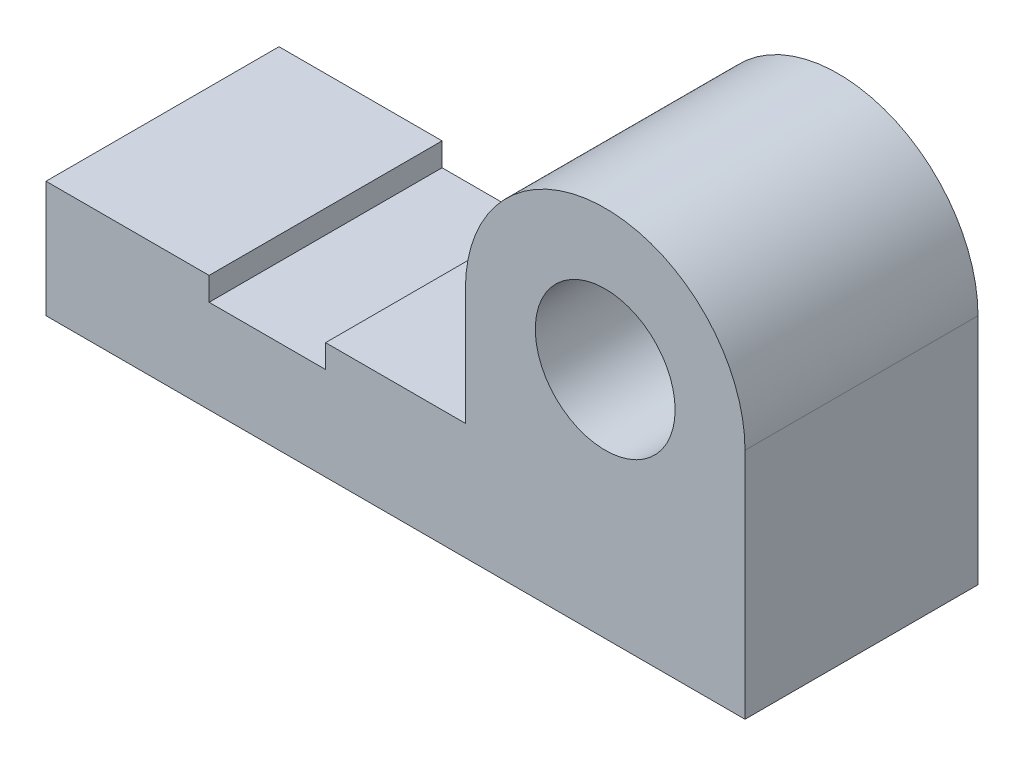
ISO-10303-21;
HEADER;
FILE_DESCRIPTION(('STEP AP214'),'2;1');
FILE_NAME('part.step','',(''),(''),'','','');
FILE_SCHEMA(('AUTOMOTIVE_DESIGN { 1 0 10303 214 1 1 1 1 }'));
ENDSEC;
DATA;
#1=APPLICATION_CONTEXT('core data for automotive mechanical design processes');
#2=APPLICATION_PROTOCOL_DEFINITION('international standard','automotive_design',2000,#1);
#3=PRODUCT_CONTEXT('',#1,'mechanical');
#4=PRODUCT('Part','Part','',(#3));
#5=PRODUCT_RELATED_PRODUCT_CATEGORY('part','',(#4));
#6=PRODUCT_DEFINITION_FORMATION('','',#4);
#7=PRODUCT_DEFINITION_CONTEXT('part definition',#1,'design');
#8=PRODUCT_DEFINITION('design','',#6,#7);
#9=PRODUCT_DEFINITION_SHAPE('','',#8);
#10=(LENGTH_UNIT() NAMED_UNIT(*) SI_UNIT(.MILLI.,.METRE.));
#11=(NAMED_UNIT(*) PLANE_ANGLE_UNIT() SI_UNIT($,.RADIAN.));
#12=(NAMED_UNIT(*) SI_UNIT($,.STERADIAN.) SOLID_ANGLE_UNIT());
#13=UNCERTAINTY_MEASURE_WITH_UNIT(LENGTH_MEASURE(1.E-05),#10,'distance_accuracy_value','');
#14=(GEOMETRIC_REPRESENTATION_CONTEXT(3) GLOBAL_UNCERTAINTY_ASSIGNED_CONTEXT((#13)) GLOBAL_UNIT_ASSIGNED_CONTEXT((#10,
#11,#12)) REPRESENTATION_CONTEXT('',''));
#15=CARTESIAN_POINT('',(0.,0.,0.));
#16=DIRECTION('',(0.,0.,1.));
#17=DIRECTION('',(1.,0.,0.));
#18=AXIS2_PLACEMENT_3D('',#15,#16,#17);
#19=CARTESIAN_POINT('',(120.,50.,50.));
#20=DIRECTION('',(0.,0.,1.));
#21=DIRECTION('',(1.,0.,0.));
#22=AXIS2_PLACEMENT_3D('',#19,#20,#21);
#23=PLANE('',#22);
#24=DIRECTION('',(0.,-1.,0.));
#25=VECTOR('',#24,1.);
#26=CARTESIAN_POINT('',(0.,25.,50.));
#27=LINE('',#26,#25);
#28=CARTESIAN_POINT('',(0.,25.,50.));
#29=VERTEX_POINT('',#28);
#30=CARTESIAN_POINT('',(0.,0.,50.));
#31=VERTEX_POINT('',#30);
#32=EDGE_CURVE('E159',#29,#31,#27,.T.);
#33=ORIENTED_EDGE('',*,*,#32,.T.);
#34=DIRECTION('',(1.,0.,0.));
#35=VECTOR('',#34,1.);
#36=CARTESIAN_POINT('',(0.,0.,50.));
#37=LINE('',#36,#35);
#38=CARTESIAN_POINT('',(150.,0.,50.));
#39=VERTEX_POINT('',#38);
#40=EDGE_CURVE('E97',#31,#39,#37,.T.);
#41=ORIENTED_EDGE('',*,*,#40,.T.);
#42=DIRECTION('',(0.,1.,0.));
#43=VECTOR('',#42,1.);
#44=CARTESIAN_POINT('',(150.,0.,50.));
#45=LINE('',#44,#43);
#46=CARTESIAN_POINT('',(150.,50.,50.));
#47=VERTEX_POINT('',#46);
#48=EDGE_CURVE('E180',#39,#47,#45,.T.);
#49=ORIENTED_EDGE('',*,*,#48,.T.);
#50=CARTESIAN_POINT('',(120.,50.,50.));
#51=DIRECTION('',(0.,0.,1.));
#52=DIRECTION('',(1.,0.,0.));
#53=AXIS2_PLACEMENT_3D('',#50,#51,#52);
#54=CIRCLE('',#53,30.);
#55=CARTESIAN_POINT('',(90.,50.,50.));
#56=VERTEX_POINT('',#55);
#57=EDGE_CURVE('E199',#47,#56,#54,.T.);
#58=ORIENTED_EDGE('',*,*,#57,.T.);
#59=DIRECTION('',(0.,-1.,0.));
#60=VECTOR('',#59,1.);
#61=CARTESIAN_POINT('',(90.,50.,50.));
#62=LINE('',#61,#60);
#63=CARTESIAN_POINT('',(90.,25.,50.));
#64=VERTEX_POINT('',#63);
#65=EDGE_CURVE('E196',#56,#64,#62,.T.);
#66=ORIENTED_EDGE('',*,*,#65,.T.);
#67=DIRECTION('',(-1.,0.,0.));
#68=VECTOR('',#67,1.);
#69=CARTESIAN_POINT('',(90.,25.,50.));
#70=LINE('',#69,#68);
#71=CARTESIAN_POINT('',(60.,25.,50.));
#72=VERTEX_POINT('',#71);
#73=EDGE_CURVE('E198',#64,#72,#70,.T.);
#74=ORIENTED_EDGE('',*,*,#73,.T.);
#75=DIRECTION('',(0.,-1.,0.));
#76=VECTOR('',#75,1.);
#77=CARTESIAN_POINT('',(60.,25.,50.));
#78=LINE('',#77,#76);
#79=CARTESIAN_POINT('',(60.,20.,50.));
#80=VERTEX_POINT('',#79);
#81=EDGE_CURVE('E122',#72,#80,#78,.T.);
#82=ORIENTED_EDGE('',*,*,#81,.T.);
#83=DIRECTION('',(-1.,0.,0.));
#84=VECTOR('',#83,1.);
#85=CARTESIAN_POINT('',(60.,20.,50.));
#86=LINE('',#85,#84);
#87=CARTESIAN_POINT('',(35.,20.,50.));
#88=VERTEX_POINT('',#87);
#89=EDGE_CURVE('E116',#80,#88,#86,.T.);
#90=ORIENTED_EDGE('',*,*,#89,.T.);
#91=DIRECTION('',(0.,1.,0.));
#92=VECTOR('',#91,1.);
#93=CARTESIAN_POINT('',(35.,20.,50.));
#94=LINE('',#93,#92);
#95=CARTESIAN_POINT('',(35.,25.,50.));
#96=VERTEX_POINT('',#95);
#97=EDGE_CURVE('E120',#88,#96,#94,.T.);
#98=ORIENTED_EDGE('',*,*,#97,.T.);
#99=DIRECTION('',(-1.,0.,0.));
#100=VECTOR('',#99,1.);
#101=CARTESIAN_POINT('',(35.,25.,50.));
#102=LINE('',#101,#100);
#103=EDGE_CURVE('E48',#96,#29,#102,.T.);
#104=ORIENTED_EDGE('',*,*,#103,.T.);
#105=EDGE_LOOP('',(#33,#41,#49,#58,#66,#74,#82,#90,#98,#104));
#106=FACE_BOUND('',#105,.T.);
#107=CARTESIAN_POINT('',(120.,50.,50.));
#108=DIRECTION('',(0.,0.,1.));
#109=DIRECTION('',(1.,0.,0.));
#110=AXIS2_PLACEMENT_3D('',#107,#108,#109);
#111=CIRCLE('',#110,15.);
#112=CARTESIAN_POINT('',(135.,50.,50.));
#113=VERTEX_POINT('',#112);
#114=EDGE_CURVE('E144',#113,#113,#111,.T.);
#115=ORIENTED_EDGE('',*,*,#114,.F.);
#116=EDGE_LOOP('',(#115));
#117=FACE_BOUND('',#116,.T.);
#118=ADVANCED_FACE('F31',(#106,#117),#23,.T.);
#119=CARTESIAN_POINT('',(120.,50.,0.));
#120=DIRECTION('',(0.,0.,1.));
#121=DIRECTION('',(1.,0.,0.));
#122=AXIS2_PLACEMENT_3D('',#119,#120,#121);
#123=PLANE('',#122);
#124=DIRECTION('',(0.,-1.,0.));
#125=VECTOR('',#124,1.);
#126=CARTESIAN_POINT('',(0.,25.,0.));
#127=LINE('',#126,#125);
#128=CARTESIAN_POINT('',(0.,25.,0.));
#129=VERTEX_POINT('',#128);
#130=CARTESIAN_POINT('',(0.,0.,0.));
#131=VERTEX_POINT('',#130);
#132=EDGE_CURVE('E140',#129,#131,#127,.T.);
#133=ORIENTED_EDGE('',*,*,#132,.F.);
#134=DIRECTION('',(-1.,0.,0.));
#135=VECTOR('',#134,1.);
#136=CARTESIAN_POINT('',(35.,25.,0.));
#137=LINE('',#136,#135);
#138=CARTESIAN_POINT('',(35.,25.,0.));
#139=VERTEX_POINT('',#138);
#140=EDGE_CURVE('E89',#139,#129,#137,.T.);
#141=ORIENTED_EDGE('',*,*,#140,.F.);
#142=DIRECTION('',(0.,1.,0.));
#143=VECTOR('',#142,1.);
#144=CARTESIAN_POINT('',(35.,20.,0.));
#145=LINE('',#144,#143);
#146=CARTESIAN_POINT('',(35.,20.,0.));
#147=VERTEX_POINT('',#146);
#148=EDGE_CURVE('E83',#147,#139,#145,.T.);
#149=ORIENTED_EDGE('',*,*,#148,.F.);
#150=DIRECTION('',(-1.,0.,0.));
#151=VECTOR('',#150,1.);
#152=CARTESIAN_POINT('',(60.,20.,0.));
#153=LINE('',#152,#151);
#154=CARTESIAN_POINT('',(60.,20.,0.));
#155=VERTEX_POINT('',#154);
#156=EDGE_CURVE('E130',#155,#147,#153,.T.);
#157=ORIENTED_EDGE('',*,*,#156,.F.);
#158=DIRECTION('',(0.,-1.,0.));
#159=VECTOR('',#158,1.);
#160=CARTESIAN_POINT('',(60.,25.,0.));
#161=LINE('',#160,#159);
#162=CARTESIAN_POINT('',(60.,25.,0.));
#163=VERTEX_POINT('',#162);
#164=EDGE_CURVE('E154',#163,#155,#161,.T.);
#165=ORIENTED_EDGE('',*,*,#164,.F.);
#166=DIRECTION('',(-1.,0.,0.));
#167=VECTOR('',#166,1.);
#168=CARTESIAN_POINT('',(90.,25.,0.));
#169=LINE('',#168,#167);
#170=CARTESIAN_POINT('',(90.,25.,0.));
#171=VERTEX_POINT('',#170);
#172=EDGE_CURVE('E152',#171,#163,#169,.T.);
#173=ORIENTED_EDGE('',*,*,#172,.F.);
#174=DIRECTION('',(0.,-1.,0.));
#175=VECTOR('',#174,1.);
#176=CARTESIAN_POINT('',(90.,50.,0.));
#177=LINE('',#176,#175);
#178=CARTESIAN_POINT('',(90.,50.,0.));
#179=VERTEX_POINT('',#178);
#180=EDGE_CURVE('E150',#179,#171,#177,.T.);
#181=ORIENTED_EDGE('',*,*,#180,.F.);
#182=CARTESIAN_POINT('',(120.,50.,0.));
#183=DIRECTION('',(0.,0.,1.));
#184=DIRECTION('',(1.,0.,0.));
#185=AXIS2_PLACEMENT_3D('',#182,#183,#184);
#186=CIRCLE('',#185,30.);
#187=CARTESIAN_POINT('',(150.,50.,0.));
#188=VERTEX_POINT('',#187);
#189=EDGE_CURVE('E148',#188,#179,#186,.T.);
#190=ORIENTED_EDGE('',*,*,#189,.F.);
#191=DIRECTION('',(0.,1.,0.));
#192=VECTOR('',#191,1.);
#193=CARTESIAN_POINT('',(150.,0.,0.));
#194=LINE('',#193,#192);
#195=CARTESIAN_POINT('',(150.,0.,0.));
#196=VERTEX_POINT('',#195);
#197=EDGE_CURVE('E146',#196,#188,#194,.T.);
#198=ORIENTED_EDGE('',*,*,#197,.F.);
#199=DIRECTION('',(1.,0.,0.));
#200=VECTOR('',#199,1.);
#201=CARTESIAN_POINT('',(0.,0.,0.));
#202=LINE('',#201,#200);
#203=EDGE_CURVE('E143',#131,#196,#202,.T.);
#204=ORIENTED_EDGE('',*,*,#203,.F.);
#205=EDGE_LOOP('',(#133,#141,#149,#157,#165,#173,#181,#190,#198,#204));
#206=FACE_BOUND('',#205,.T.);
#207=CARTESIAN_POINT('',(120.,50.,0.));
#208=DIRECTION('',(0.,0.,1.));
#209=DIRECTION('',(1.,0.,0.));
#210=AXIS2_PLACEMENT_3D('',#207,#208,#209);
#211=CIRCLE('',#210,15.);
#212=CARTESIAN_POINT('',(135.,50.,0.));
#213=VERTEX_POINT('',#212);
#214=EDGE_CURVE('E207',#213,#213,#211,.T.);
#215=ORIENTED_EDGE('',*,*,#214,.T.);
#216=EDGE_LOOP('',(#215));
#217=FACE_BOUND('',#216,.T.);
#218=ADVANCED_FACE('F184',(#206,#217),#123,.F.);
#219=CARTESIAN_POINT('',(0.,25.,50.));
#220=DIRECTION('',(1.,0.,0.));
#221=DIRECTION('',(0.,1.,0.));
#222=AXIS2_PLACEMENT_3D('',#219,#220,#221);
#223=PLANE('',#222);
#224=ORIENTED_EDGE('',*,*,#132,.T.);
#225=DIRECTION('',(0.,0.,-1.));
#226=VECTOR('',#225,1.);
#227=CARTESIAN_POINT('',(0.,0.,50.));
#228=LINE('',#227,#226);
#229=EDGE_CURVE('E11',#31,#131,#228,.T.);
#230=ORIENTED_EDGE('',*,*,#229,.F.);
#231=ORIENTED_EDGE('',*,*,#32,.F.);
#232=DIRECTION('',(0.,0.,-1.));
#233=VECTOR('',#232,1.);
#234=CARTESIAN_POINT('',(0.,25.,50.));
#235=LINE('',#234,#233);
#236=EDGE_CURVE('E136',#29,#129,#235,.T.);
#237=ORIENTED_EDGE('',*,*,#236,.T.);
#238=EDGE_LOOP('',(#224,#230,#231,#237));
#239=FACE_BOUND('',#238,.T.);
#240=ADVANCED_FACE('F33',(#239),#223,.F.);
#241=CARTESIAN_POINT('',(0.,0.,50.));
#242=DIRECTION('',(0.,1.,0.));
#243=DIRECTION('',(0.,0.,1.));
#244=AXIS2_PLACEMENT_3D('',#241,#242,#243);
#245=PLANE('',#244);
#246=ORIENTED_EDGE('',*,*,#203,.T.);
#247=DIRECTION('',(0.,0.,-1.));
#248=VECTOR('',#247,1.);
#249=CARTESIAN_POINT('',(150.,0.,50.));
#250=LINE('',#249,#248);
#251=EDGE_CURVE('E40',#39,#196,#250,.T.);
#252=ORIENTED_EDGE('',*,*,#251,.F.);
#253=ORIENTED_EDGE('',*,*,#40,.F.);
#254=ORIENTED_EDGE('',*,*,#229,.T.);
#255=EDGE_LOOP('',(#246,#252,#253,#254));
#256=FACE_BOUND('',#255,.T.);
#257=ADVANCED_FACE('F243',(#256),#245,.F.);
#258=CARTESIAN_POINT('',(150.,0.,50.));
#259=DIRECTION('',(-1.,0.,0.));
#260=DIRECTION('',(0.,-1.,0.));
#261=AXIS2_PLACEMENT_3D('',#258,#259,#260);
#262=PLANE('',#261);
#263=ORIENTED_EDGE('',*,*,#197,.T.);
#264=DIRECTION('',(0.,0.,-1.));
#265=VECTOR('',#264,1.);
#266=CARTESIAN_POINT('',(150.,50.,50.));
#267=LINE('',#266,#265);
#268=EDGE_CURVE('E172',#47,#188,#267,.T.);
#269=ORIENTED_EDGE('',*,*,#268,.F.);
#270=ORIENTED_EDGE('',*,*,#48,.F.);
#271=ORIENTED_EDGE('',*,*,#251,.T.);
#272=EDGE_LOOP('',(#263,#269,#270,#271));
#273=FACE_BOUND('',#272,.T.);
#274=ADVANCED_FACE('F178',(#273),#262,.F.);
#275=CARTESIAN_POINT('',(120.,50.,50.));
#276=DIRECTION('',(0.,0.,-1.));
#277=DIRECTION('',(-1.,0.,0.));
#278=AXIS2_PLACEMENT_3D('',#275,#276,#277);
#279=CYLINDRICAL_SURFACE('',#278,30.);
#280=ORIENTED_EDGE('',*,*,#189,.T.);
#281=DIRECTION('',(0.,0.,-1.));
#282=VECTOR('',#281,1.);
#283=CARTESIAN_POINT('',(90.,50.,50.));
#284=LINE('',#283,#282);
#285=EDGE_CURVE('E169',#56,#179,#284,.T.);
#286=ORIENTED_EDGE('',*,*,#285,.F.);
#287=ORIENTED_EDGE('',*,*,#57,.F.);
#288=ORIENTED_EDGE('',*,*,#268,.T.);
#289=EDGE_LOOP('',(#280,#286,#287,#288));
#290=FACE_BOUND('',#289,.T.);
#291=ADVANCED_FACE('F190',(#290),#279,.T.);
#292=CARTESIAN_POINT('',(90.,50.,50.));
#293=DIRECTION('',(1.,0.,0.));
#294=DIRECTION('',(0.,0.,-1.));
#295=AXIS2_PLACEMENT_3D('',#292,#293,#294);
#296=PLANE('',#295);
#297=ORIENTED_EDGE('',*,*,#180,.T.);
#298=DIRECTION('',(0.,0.,-1.));
#299=VECTOR('',#298,1.);
#300=CARTESIAN_POINT('',(90.,25.,50.));
#301=LINE('',#300,#299);
#302=EDGE_CURVE('E166',#64,#171,#301,.T.);
#303=ORIENTED_EDGE('',*,*,#302,.F.);
#304=ORIENTED_EDGE('',*,*,#65,.F.);
#305=ORIENTED_EDGE('',*,*,#285,.T.);
#306=EDGE_LOOP('',(#297,#303,#304,#305));
#307=FACE_BOUND('',#306,.T.);
#308=ADVANCED_FACE('F194',(#307),#296,.F.);
#309=CARTESIAN_POINT('',(90.,25.,50.));
#310=DIRECTION('',(0.,-1.,0.));
#311=DIRECTION('',(1.,0.,0.));
#312=AXIS2_PLACEMENT_3D('',#309,#310,#311);
#313=PLANE('',#312);
#314=ORIENTED_EDGE('',*,*,#172,.T.);
#315=DIRECTION('',(0.,0.,-1.));
#316=VECTOR('',#315,1.);
#317=CARTESIAN_POINT('',(60.,25.,50.));
#318=LINE('',#317,#316);
#319=EDGE_CURVE('E163',#72,#163,#318,.T.);
#320=ORIENTED_EDGE('',*,*,#319,.F.);
#321=ORIENTED_EDGE('',*,*,#73,.F.);
#322=ORIENTED_EDGE('',*,*,#302,.T.);
#323=EDGE_LOOP('',(#314,#320,#321,#322));
#324=FACE_BOUND('',#323,.T.);
#325=ADVANCED_FACE('F233',(#324),#313,.F.);
#326=CARTESIAN_POINT('',(60.,25.,50.));
#327=DIRECTION('',(1.,0.,0.));
#328=DIRECTION('',(0.,1.,0.));
#329=AXIS2_PLACEMENT_3D('',#326,#327,#328);
#330=PLANE('',#329);
#331=ORIENTED_EDGE('',*,*,#164,.T.);
#332=DIRECTION('',(0.,0.,-1.));
#333=VECTOR('',#332,1.);
#334=CARTESIAN_POINT('',(60.,20.,50.));
#335=LINE('',#334,#333);
#336=EDGE_CURVE('E131',#80,#155,#335,.T.);
#337=ORIENTED_EDGE('',*,*,#336,.F.);
#338=ORIENTED_EDGE('',*,*,#81,.F.);
#339=ORIENTED_EDGE('',*,*,#319,.T.);
#340=EDGE_LOOP('',(#331,#337,#338,#339));
#341=FACE_BOUND('',#340,.T.);
#342=ADVANCED_FACE('F230',(#341),#330,.F.);
#343=CARTESIAN_POINT('',(60.,20.,50.));
#344=DIRECTION('',(0.,-1.,0.));
#345=DIRECTION('',(0.,0.,-1.));
#346=AXIS2_PLACEMENT_3D('',#343,#344,#345);
#347=PLANE('',#346);
#348=ORIENTED_EDGE('',*,*,#156,.T.);
#349=DIRECTION('',(0.,0.,-1.));
#350=VECTOR('',#349,1.);
#351=CARTESIAN_POINT('',(35.,20.,50.));
#352=LINE('',#351,#350);
#353=EDGE_CURVE('E127',#88,#147,#352,.T.);
#354=ORIENTED_EDGE('',*,*,#353,.F.);
#355=ORIENTED_EDGE('',*,*,#89,.F.);
#356=ORIENTED_EDGE('',*,*,#336,.T.);
#357=EDGE_LOOP('',(#348,#354,#355,#356));
#358=FACE_BOUND('',#357,.T.);
#359=ADVANCED_FACE('F128',(#358),#347,.F.);
#360=CARTESIAN_POINT('',(35.,20.,50.));
#361=DIRECTION('',(-1.,0.,0.));
#362=DIRECTION('',(0.,0.,1.));
#363=AXIS2_PLACEMENT_3D('',#360,#361,#362);
#364=PLANE('',#363);
#365=ORIENTED_EDGE('',*,*,#148,.T.);
#366=DIRECTION('',(0.,0.,-1.));
#367=VECTOR('',#366,1.);
#368=CARTESIAN_POINT('',(35.,25.,50.));
#369=LINE('',#368,#367);
#370=EDGE_CURVE('E132',#96,#139,#369,.T.);
#371=ORIENTED_EDGE('',*,*,#370,.F.);
#372=ORIENTED_EDGE('',*,*,#97,.F.);
#373=ORIENTED_EDGE('',*,*,#353,.T.);
#374=EDGE_LOOP('',(#365,#371,#372,#373));
#375=FACE_BOUND('',#374,.T.);
#376=ADVANCED_FACE('F134',(#375),#364,.F.);
#377=CARTESIAN_POINT('',(35.,25.,50.));
#378=DIRECTION('',(0.,-1.,0.));
#379=DIRECTION('',(1.,0.,0.));
#380=AXIS2_PLACEMENT_3D('',#377,#378,#379);
#381=PLANE('',#380);
#382=ORIENTED_EDGE('',*,*,#140,.T.);
#383=ORIENTED_EDGE('',*,*,#236,.F.);
#384=ORIENTED_EDGE('',*,*,#103,.F.);
#385=ORIENTED_EDGE('',*,*,#370,.T.);
#386=EDGE_LOOP('',(#382,#383,#384,#385));
#387=FACE_BOUND('',#386,.T.);
#388=ADVANCED_FACE('F223',(#387),#381,.F.);
#389=CARTESIAN_POINT('',(120.,50.,50.));
#390=DIRECTION('',(0.,0.,-1.));
#391=DIRECTION('',(-1.,0.,0.));
#392=AXIS2_PLACEMENT_3D('',#389,#390,#391);
#393=CYLINDRICAL_SURFACE('',#392,15.);
#394=ORIENTED_EDGE('',*,*,#114,.T.);
#395=EDGE_LOOP('',(#394));
#396=FACE_BOUND('',#395,.T.);
#397=ORIENTED_EDGE('',*,*,#214,.F.);
#398=EDGE_LOOP('',(#397));
#399=FACE_BOUND('',#398,.T.);
#400=ADVANCED_FACE('F213',(#396,#399),#393,.F.);
#401=CLOSED_SHELL('',(#118,#218,#240,#257,#274,#291,#308,#325,#342,#359,#376,#388,#400));
#402=MANIFOLD_SOLID_BREP('B2',#401);
#403=ADVANCED_BREP_SHAPE_REPRESENTATION('',(#18,#402),#14);
#404=SHAPE_DEFINITION_REPRESENTATION(#9,#403);
ENDSEC;
END-ISO-10303-21;
